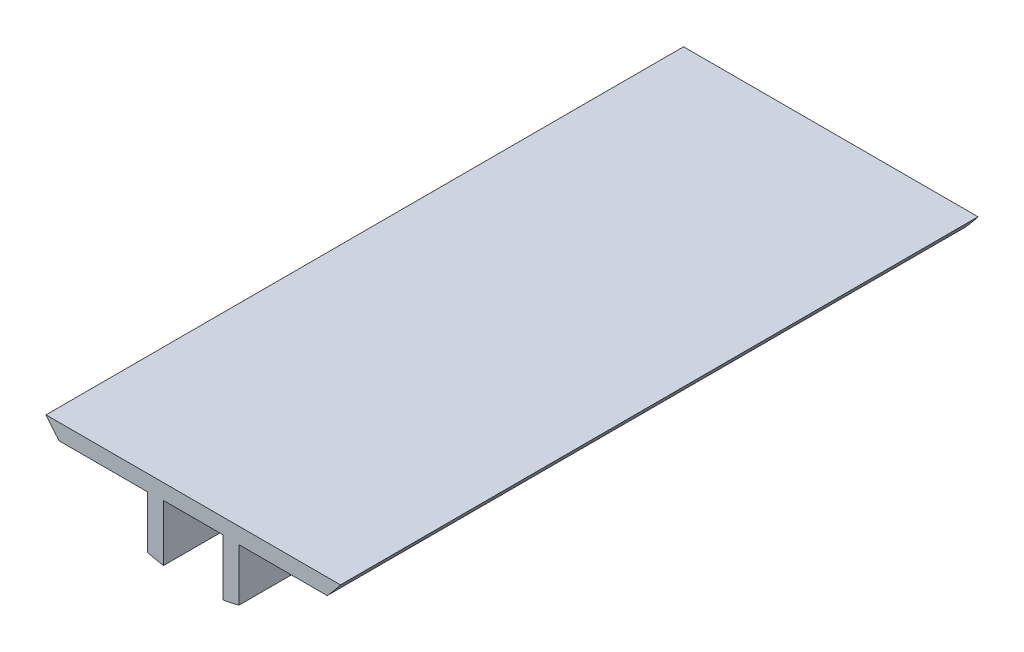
ISO-10303-21;
HEADER;
FILE_DESCRIPTION(('STEP AP214'),'2;1');
FILE_NAME('part.step','',(''),(''),'','','');
FILE_SCHEMA(('AUTOMOTIVE_DESIGN { 1 0 10303 214 1 1 1 1 }'));
ENDSEC;
DATA;
#1=APPLICATION_CONTEXT('core data for automotive mechanical design processes');
#2=APPLICATION_PROTOCOL_DEFINITION('international standard','automotive_design',2000,#1);
#3=PRODUCT_CONTEXT('',#1,'mechanical');
#4=PRODUCT('Part','Part','',(#3));
#5=PRODUCT_RELATED_PRODUCT_CATEGORY('part','',(#4));
#6=PRODUCT_DEFINITION_FORMATION('','',#4);
#7=PRODUCT_DEFINITION_CONTEXT('part definition',#1,'design');
#8=PRODUCT_DEFINITION('design','',#6,#7);
#9=PRODUCT_DEFINITION_SHAPE('','',#8);
#10=(LENGTH_UNIT() NAMED_UNIT(*) SI_UNIT(.MILLI.,.METRE.));
#11=(NAMED_UNIT(*) PLANE_ANGLE_UNIT() SI_UNIT($,.RADIAN.));
#12=(NAMED_UNIT(*) SI_UNIT($,.STERADIAN.) SOLID_ANGLE_UNIT());
#13=UNCERTAINTY_MEASURE_WITH_UNIT(LENGTH_MEASURE(1.E-05),#10,'distance_accuracy_value','');
#14=(GEOMETRIC_REPRESENTATION_CONTEXT(3) GLOBAL_UNCERTAINTY_ASSIGNED_CONTEXT((#13)) GLOBAL_UNIT_ASSIGNED_CONTEXT((#10,
#11,#12)) REPRESENTATION_CONTEXT('',''));
#15=CARTESIAN_POINT('',(0.,0.,0.));
#16=DIRECTION('',(0.,0.,1.));
#17=DIRECTION('',(1.,0.,0.));
#18=AXIS2_PLACEMENT_3D('',#15,#16,#17);
#19=CARTESIAN_POINT('',(0.,0.,-6000.));
#20=DIRECTION('',(0.,0.,1.));
#21=DIRECTION('',(1.,0.,0.));
#22=AXIS2_PLACEMENT_3D('',#19,#20,#21);
#23=CYLINDRICAL_SURFACE('',#22,1723.5);
#24=CARTESIAN_POINT('',(0.,0.,0.));
#25=DIRECTION('',(0.,0.,1.));
#26=DIRECTION('',(1.,0.,0.));
#27=AXIS2_PLACEMENT_3D('',#24,#25,#26);
#28=CIRCLE('',#27,1723.5);
#29=CARTESIAN_POINT('',(-1385.57830886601,-1025.,0.));
#30=VERTEX_POINT('',#29);
#31=CARTESIAN_POINT('',(-1260.88351960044,-1175.,0.));
#32=VERTEX_POINT('',#31);
#33=EDGE_CURVE('E166',#30,#32,#28,.T.);
#34=ORIENTED_EDGE('',*,*,#33,.F.);
#35=DIRECTION('',(0.,0.,1.));
#36=VECTOR('',#35,1.);
#37=CARTESIAN_POINT('',(-1385.57830886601,-1025.,-6000.));
#38=LINE('',#37,#36);
#39=CARTESIAN_POINT('',(-1385.57830886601,-1025.,-6000.));
#40=VERTEX_POINT('',#39);
#41=EDGE_CURVE('E11',#40,#30,#38,.T.);
#42=ORIENTED_EDGE('',*,*,#41,.F.);
#43=CARTESIAN_POINT('',(0.,0.,-6000.));
#44=DIRECTION('',(0.,0.,1.));
#45=DIRECTION('',(1.,0.,0.));
#46=AXIS2_PLACEMENT_3D('',#43,#44,#45);
#47=CIRCLE('',#46,1723.5);
#48=CARTESIAN_POINT('',(-1260.88351960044,-1175.,-6000.));
#49=VERTEX_POINT('',#48);
#50=EDGE_CURVE('E210',#40,#49,#47,.T.);
#51=ORIENTED_EDGE('',*,*,#50,.T.);
#52=DIRECTION('',(0.,0.,1.));
#53=VECTOR('',#52,1.);
#54=CARTESIAN_POINT('',(-1260.88351960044,-1175.,-6000.));
#55=LINE('',#54,#53);
#56=EDGE_CURVE('E42',#49,#32,#55,.T.);
#57=ORIENTED_EDGE('',*,*,#56,.T.);
#58=EDGE_LOOP('',(#34,#42,#51,#57));
#59=FACE_BOUND('',#58,.T.);
#60=ADVANCED_FACE('F39',(#59),#23,.T.);
#61=CARTESIAN_POINT('',(1385.57830886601,-1025.,-6000.));
#62=DIRECTION('',(0.,1.,0.));
#63=DIRECTION('',(-1.,0.,0.));
#64=AXIS2_PLACEMENT_3D('',#61,#62,#63);
#65=PLANE('',#64);
#66=DIRECTION('',(-1.,0.,0.));
#67=VECTOR('',#66,1.);
#68=CARTESIAN_POINT('',(1385.57830886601,-1025.,0.));
#69=LINE('',#68,#67);
#70=CARTESIAN_POINT('',(1385.57830886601,-1025.,0.));
#71=VERTEX_POINT('',#70);
#72=EDGE_CURVE('E207',#71,#30,#69,.T.);
#73=ORIENTED_EDGE('',*,*,#72,.F.);
#74=DIRECTION('',(0.,0.,1.));
#75=VECTOR('',#74,1.);
#76=CARTESIAN_POINT('',(1385.57830886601,-1025.,-6000.));
#77=LINE('',#76,#75);
#78=CARTESIAN_POINT('',(1385.57830886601,-1025.,-6000.));
#79=VERTEX_POINT('',#78);
#80=EDGE_CURVE('E49',#79,#71,#77,.T.);
#81=ORIENTED_EDGE('',*,*,#80,.F.);
#82=DIRECTION('',(-1.,0.,0.));
#83=VECTOR('',#82,1.);
#84=CARTESIAN_POINT('',(1385.57830886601,-1025.,-6000.));
#85=LINE('',#84,#83);
#86=EDGE_CURVE('E152',#79,#40,#85,.T.);
#87=ORIENTED_EDGE('',*,*,#86,.T.);
#88=ORIENTED_EDGE('',*,*,#41,.T.);
#89=EDGE_LOOP('',(#73,#81,#87,#88));
#90=FACE_BOUND('',#89,.T.);
#91=ADVANCED_FACE('F240',(#90),#65,.T.);
#92=CARTESIAN_POINT('',(0.,0.,-6000.));
#93=DIRECTION('',(0.,0.,1.));
#94=DIRECTION('',(1.,0.,0.));
#95=AXIS2_PLACEMENT_3D('',#92,#93,#94);
#96=CYLINDRICAL_SURFACE('',#95,1723.5);
#97=CARTESIAN_POINT('',(0.,0.,0.));
#98=DIRECTION('',(0.,0.,1.));
#99=DIRECTION('',(-1.,0.,0.));
#100=AXIS2_PLACEMENT_3D('',#97,#98,#99);
#101=CIRCLE('',#100,1723.5);
#102=CARTESIAN_POINT('',(1260.88351960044,-1175.,0.));
#103=VERTEX_POINT('',#102);
#104=EDGE_CURVE('E138',#103,#71,#101,.T.);
#105=ORIENTED_EDGE('',*,*,#104,.F.);
#106=DIRECTION('',(0.,0.,1.));
#107=VECTOR('',#106,1.);
#108=CARTESIAN_POINT('',(1260.88351960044,-1175.,-6000.));
#109=LINE('',#108,#107);
#110=CARTESIAN_POINT('',(1260.88351960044,-1175.,-6000.));
#111=VERTEX_POINT('',#110);
#112=EDGE_CURVE('E133',#111,#103,#109,.T.);
#113=ORIENTED_EDGE('',*,*,#112,.F.);
#114=CARTESIAN_POINT('',(0.,0.,-6000.));
#115=DIRECTION('',(0.,0.,1.));
#116=DIRECTION('',(-1.,0.,0.));
#117=AXIS2_PLACEMENT_3D('',#114,#115,#116);
#118=CIRCLE('',#117,1723.5);
#119=EDGE_CURVE('E136',#111,#79,#118,.T.);
#120=ORIENTED_EDGE('',*,*,#119,.T.);
#121=ORIENTED_EDGE('',*,*,#80,.T.);
#122=EDGE_LOOP('',(#105,#113,#120,#121));
#123=FACE_BOUND('',#122,.T.);
#124=ADVANCED_FACE('F135',(#123),#96,.T.);
#125=CARTESIAN_POINT('',(1260.88351960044,-1175.,-6000.));
#126=DIRECTION('',(0.,-1.,0.));
#127=DIRECTION('',(1.,0.,0.));
#128=AXIS2_PLACEMENT_3D('',#125,#126,#127);
#129=PLANE('',#128);
#130=DIRECTION('',(1.,0.,0.));
#131=VECTOR('',#130,1.);
#132=CARTESIAN_POINT('',(1260.88351960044,-1175.,0.));
#133=LINE('',#132,#131);
#134=CARTESIAN_POINT('',(429.805300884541,-1175.,0.));
#135=VERTEX_POINT('',#134);
#136=EDGE_CURVE('E202',#135,#103,#133,.T.);
#137=ORIENTED_EDGE('',*,*,#136,.F.);
#138=DIRECTION('',(0.,0.,1.));
#139=VECTOR('',#138,1.);
#140=CARTESIAN_POINT('',(429.805300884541,-1175.,-6000.));
#141=LINE('',#140,#139);
#142=CARTESIAN_POINT('',(429.805300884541,-1175.,-6000.));
#143=VERTEX_POINT('',#142);
#144=EDGE_CURVE('E144',#143,#135,#141,.T.);
#145=ORIENTED_EDGE('',*,*,#144,.F.);
#146=DIRECTION('',(1.,0.,0.));
#147=VECTOR('',#146,1.);
#148=CARTESIAN_POINT('',(1260.88351960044,-1175.,-6000.));
#149=LINE('',#148,#147);
#150=EDGE_CURVE('E150',#143,#111,#149,.T.);
#151=ORIENTED_EDGE('',*,*,#150,.T.);
#152=ORIENTED_EDGE('',*,*,#112,.T.);
#153=EDGE_LOOP('',(#137,#145,#151,#152));
#154=FACE_BOUND('',#153,.T.);
#155=ADVANCED_FACE('F155',(#154),#129,.T.);
#156=CARTESIAN_POINT('',(429.805300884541,-1175.,-6000.));
#157=DIRECTION('',(1.,0.,0.));
#158=DIRECTION('',(0.,1.,0.));
#159=AXIS2_PLACEMENT_3D('',#156,#157,#158);
#160=PLANE('',#159);
#161=DIRECTION('',(0.,1.,0.));
#162=VECTOR('',#161,1.);
#163=CARTESIAN_POINT('',(429.805300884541,-1175.,0.));
#164=LINE('',#163,#162);
#165=CARTESIAN_POINT('',(429.805300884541,-1669.04752878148,0.));
#166=VERTEX_POINT('',#165);
#167=EDGE_CURVE('E198',#166,#135,#164,.T.);
#168=ORIENTED_EDGE('',*,*,#167,.F.);
#169=DIRECTION('',(0.,0.,1.));
#170=VECTOR('',#169,1.);
#171=CARTESIAN_POINT('',(429.805300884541,-1669.04752878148,-6000.));
#172=LINE('',#171,#170);
#173=CARTESIAN_POINT('',(429.805300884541,-1669.04752878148,-6000.));
#174=VERTEX_POINT('',#173);
#175=EDGE_CURVE('E216',#174,#166,#172,.T.);
#176=ORIENTED_EDGE('',*,*,#175,.F.);
#177=DIRECTION('',(0.,1.,0.));
#178=VECTOR('',#177,1.);
#179=CARTESIAN_POINT('',(429.805300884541,-1175.,-6000.));
#180=LINE('',#179,#178);
#181=EDGE_CURVE('E157',#174,#143,#180,.T.);
#182=ORIENTED_EDGE('',*,*,#181,.T.);
#183=ORIENTED_EDGE('',*,*,#144,.T.);
#184=EDGE_LOOP('',(#168,#176,#182,#183));
#185=FACE_BOUND('',#184,.T.);
#186=ADVANCED_FACE('F253',(#185),#160,.T.);
#187=CARTESIAN_POINT('',(0.,0.,-6000.));
#188=DIRECTION('',(0.,0.,1.));
#189=DIRECTION('',(1.,0.,0.));
#190=AXIS2_PLACEMENT_3D('',#187,#188,#189);
#191=CYLINDRICAL_SURFACE('',#190,1723.5);
#192=CARTESIAN_POINT('',(0.,0.,0.));
#193=DIRECTION('',(0.,0.,1.));
#194=DIRECTION('',(-1.,0.,0.));
#195=AXIS2_PLACEMENT_3D('',#192,#193,#194);
#196=CIRCLE('',#195,1723.5);
#197=CARTESIAN_POINT('',(279.805300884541,-1700.63554108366,0.));
#198=VERTEX_POINT('',#197);
#199=EDGE_CURVE('E194',#198,#166,#196,.T.);
#200=ORIENTED_EDGE('',*,*,#199,.F.);
#201=DIRECTION('',(0.,0.,1.));
#202=VECTOR('',#201,1.);
#203=CARTESIAN_POINT('',(279.805300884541,-1700.63554108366,-6000.));
#204=LINE('',#203,#202);
#205=CARTESIAN_POINT('',(279.805300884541,-1700.63554108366,-6000.));
#206=VERTEX_POINT('',#205);
#207=EDGE_CURVE('E219',#206,#198,#204,.T.);
#208=ORIENTED_EDGE('',*,*,#207,.F.);
#209=CARTESIAN_POINT('',(0.,0.,-6000.));
#210=DIRECTION('',(0.,0.,1.));
#211=DIRECTION('',(-1.,0.,0.));
#212=AXIS2_PLACEMENT_3D('',#209,#210,#211);
#213=CIRCLE('',#212,1723.5);
#214=EDGE_CURVE('E160',#206,#174,#213,.T.);
#215=ORIENTED_EDGE('',*,*,#214,.T.);
#216=ORIENTED_EDGE('',*,*,#175,.T.);
#217=EDGE_LOOP('',(#200,#208,#215,#216));
#218=FACE_BOUND('',#217,.T.);
#219=ADVANCED_FACE('F256',(#218),#191,.T.);
#220=CARTESIAN_POINT('',(279.805300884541,-1700.63554108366,-6000.));
#221=DIRECTION('',(-1.,0.,0.));
#222=DIRECTION('',(0.,-1.,0.));
#223=AXIS2_PLACEMENT_3D('',#220,#221,#222);
#224=PLANE('',#223);
#225=DIRECTION('',(0.,-1.,0.));
#226=VECTOR('',#225,1.);
#227=CARTESIAN_POINT('',(279.805300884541,-1700.63554108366,0.));
#228=LINE('',#227,#226);
#229=CARTESIAN_POINT('',(279.805300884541,-1169.79138438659,0.));
#230=VERTEX_POINT('',#229);
#231=EDGE_CURVE('E190',#230,#198,#228,.T.);
#232=ORIENTED_EDGE('',*,*,#231,.F.);
#233=DIRECTION('',(0.,0.,1.));
#234=VECTOR('',#233,1.);
#235=CARTESIAN_POINT('',(279.805300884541,-1169.79138438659,-6000.));
#236=LINE('',#235,#234);
#237=CARTESIAN_POINT('',(279.805300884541,-1169.79138438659,-6000.));
#238=VERTEX_POINT('',#237);
#239=EDGE_CURVE('E222',#238,#230,#236,.T.);
#240=ORIENTED_EDGE('',*,*,#239,.F.);
#241=DIRECTION('',(0.,-1.,0.));
#242=VECTOR('',#241,1.);
#243=CARTESIAN_POINT('',(279.805300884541,-1700.63554108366,-6000.));
#244=LINE('',#243,#242);
#245=EDGE_CURVE('E382',#238,#206,#244,.T.);
#246=ORIENTED_EDGE('',*,*,#245,.T.);
#247=ORIENTED_EDGE('',*,*,#207,.T.);
#248=EDGE_LOOP('',(#232,#240,#246,#247));
#249=FACE_BOUND('',#248,.T.);
#250=ADVANCED_FACE('F260',(#249),#224,.T.);
#251=CARTESIAN_POINT('',(-279.805300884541,-1169.79138438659,-6000.));
#252=DIRECTION('',(0.,-1.,0.));
#253=DIRECTION('',(1.,0.,0.));
#254=AXIS2_PLACEMENT_3D('',#251,#252,#253);
#255=PLANE('',#254);
#256=DIRECTION('',(1.,0.,0.));
#257=VECTOR('',#256,1.);
#258=CARTESIAN_POINT('',(-279.805300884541,-1169.79138438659,0.));
#259=LINE('',#258,#257);
#260=CARTESIAN_POINT('',(-279.805300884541,-1169.79138438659,0.));
#261=VERTEX_POINT('',#260);
#262=EDGE_CURVE('E186',#261,#230,#259,.T.);
#263=ORIENTED_EDGE('',*,*,#262,.F.);
#264=DIRECTION('',(0.,0.,1.));
#265=VECTOR('',#264,1.);
#266=CARTESIAN_POINT('',(-279.805300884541,-1169.79138438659,-6000.));
#267=LINE('',#266,#265);
#268=CARTESIAN_POINT('',(-279.805300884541,-1169.79138438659,-6000.));
#269=VERTEX_POINT('',#268);
#270=EDGE_CURVE('E225',#269,#261,#267,.T.);
#271=ORIENTED_EDGE('',*,*,#270,.F.);
#272=DIRECTION('',(1.,0.,0.));
#273=VECTOR('',#272,1.);
#274=CARTESIAN_POINT('',(-279.805300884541,-1169.79138438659,-6000.));
#275=LINE('',#274,#273);
#276=EDGE_CURVE('E388',#269,#238,#275,.T.);
#277=ORIENTED_EDGE('',*,*,#276,.T.);
#278=ORIENTED_EDGE('',*,*,#239,.T.);
#279=EDGE_LOOP('',(#263,#271,#277,#278));
#280=FACE_BOUND('',#279,.T.);
#281=ADVANCED_FACE('F264',(#280),#255,.T.);
#282=CARTESIAN_POINT('',(-279.805300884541,-1700.63554108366,-6000.));
#283=DIRECTION('',(1.,0.,0.));
#284=DIRECTION('',(0.,0.,-1.));
#285=AXIS2_PLACEMENT_3D('',#282,#283,#284);
#286=PLANE('',#285);
#287=DIRECTION('',(0.,1.,0.));
#288=VECTOR('',#287,1.);
#289=CARTESIAN_POINT('',(-279.805300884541,-1700.63554108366,0.));
#290=LINE('',#289,#288);
#291=CARTESIAN_POINT('',(-279.805300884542,-1700.63554108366,0.));
#292=VERTEX_POINT('',#291);
#293=EDGE_CURVE('E182',#292,#261,#290,.T.);
#294=ORIENTED_EDGE('',*,*,#293,.F.);
#295=DIRECTION('',(0.,0.,1.));
#296=VECTOR('',#295,1.);
#297=CARTESIAN_POINT('',(-279.805300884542,-1700.63554108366,-6000.));
#298=LINE('',#297,#296);
#299=CARTESIAN_POINT('',(-279.805300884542,-1700.63554108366,-6000.));
#300=VERTEX_POINT('',#299);
#301=EDGE_CURVE('E228',#300,#292,#298,.T.);
#302=ORIENTED_EDGE('',*,*,#301,.F.);
#303=DIRECTION('',(0.,1.,0.));
#304=VECTOR('',#303,1.);
#305=CARTESIAN_POINT('',(-279.805300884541,-1700.63554108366,-6000.));
#306=LINE('',#305,#304);
#307=EDGE_CURVE('E375',#300,#269,#306,.T.);
#308=ORIENTED_EDGE('',*,*,#307,.T.);
#309=ORIENTED_EDGE('',*,*,#270,.T.);
#310=EDGE_LOOP('',(#294,#302,#308,#309));
#311=FACE_BOUND('',#310,.T.);
#312=ADVANCED_FACE('F268',(#311),#286,.T.);
#313=CARTESIAN_POINT('',(0.,0.,-6000.));
#314=DIRECTION('',(0.,0.,1.));
#315=DIRECTION('',(1.,0.,0.));
#316=AXIS2_PLACEMENT_3D('',#313,#314,#315);
#317=CYLINDRICAL_SURFACE('',#316,1723.5);
#318=CARTESIAN_POINT('',(0.,0.,0.));
#319=DIRECTION('',(0.,0.,1.));
#320=DIRECTION('',(1.,0.,0.));
#321=AXIS2_PLACEMENT_3D('',#318,#319,#320);
#322=CIRCLE('',#321,1723.5);
#323=CARTESIAN_POINT('',(-429.805300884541,-1669.04752878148,0.));
#324=VERTEX_POINT('',#323);
#325=EDGE_CURVE('E178',#324,#292,#322,.T.);
#326=ORIENTED_EDGE('',*,*,#325,.F.);
#327=DIRECTION('',(0.,0.,1.));
#328=VECTOR('',#327,1.);
#329=CARTESIAN_POINT('',(-429.805300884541,-1669.04752878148,-6000.));
#330=LINE('',#329,#328);
#331=CARTESIAN_POINT('',(-429.805300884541,-1669.04752878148,-6000.));
#332=VERTEX_POINT('',#331);
#333=EDGE_CURVE('E231',#332,#324,#330,.T.);
#334=ORIENTED_EDGE('',*,*,#333,.F.);
#335=CARTESIAN_POINT('',(0.,0.,-6000.));
#336=DIRECTION('',(0.,0.,1.));
#337=DIRECTION('',(1.,0.,0.));
#338=AXIS2_PLACEMENT_3D('',#335,#336,#337);
#339=CIRCLE('',#338,1723.5);
#340=EDGE_CURVE('E371',#332,#300,#339,.T.);
#341=ORIENTED_EDGE('',*,*,#340,.T.);
#342=ORIENTED_EDGE('',*,*,#301,.T.);
#343=EDGE_LOOP('',(#326,#334,#341,#342));
#344=FACE_BOUND('',#343,.T.);
#345=ADVANCED_FACE('F272',(#344),#317,.T.);
#346=CARTESIAN_POINT('',(-429.805300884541,-1175.,-6000.));
#347=DIRECTION('',(-1.,0.,0.));
#348=DIRECTION('',(0.,-1.,0.));
#349=AXIS2_PLACEMENT_3D('',#346,#347,#348);
#350=PLANE('',#349);
#351=DIRECTION('',(0.,-1.,0.));
#352=VECTOR('',#351,1.);
#353=CARTESIAN_POINT('',(-429.805300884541,-1175.,0.));
#354=LINE('',#353,#352);
#355=CARTESIAN_POINT('',(-429.805300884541,-1175.,0.));
#356=VERTEX_POINT('',#355);
#357=EDGE_CURVE('E174',#356,#324,#354,.T.);
#358=ORIENTED_EDGE('',*,*,#357,.F.);
#359=DIRECTION('',(0.,0.,1.));
#360=VECTOR('',#359,1.);
#361=CARTESIAN_POINT('',(-429.805300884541,-1175.,-6000.));
#362=LINE('',#361,#360);
#363=CARTESIAN_POINT('',(-429.805300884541,-1175.,-6000.));
#364=VERTEX_POINT('',#363);
#365=EDGE_CURVE('E233',#364,#356,#362,.T.);
#366=ORIENTED_EDGE('',*,*,#365,.F.);
#367=DIRECTION('',(0.,-1.,0.));
#368=VECTOR('',#367,1.);
#369=CARTESIAN_POINT('',(-429.805300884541,-1175.,-6000.));
#370=LINE('',#369,#368);
#371=EDGE_CURVE('E397',#364,#332,#370,.T.);
#372=ORIENTED_EDGE('',*,*,#371,.T.);
#373=ORIENTED_EDGE('',*,*,#333,.T.);
#374=EDGE_LOOP('',(#358,#366,#372,#373));
#375=FACE_BOUND('',#374,.T.);
#376=ADVANCED_FACE('F276',(#375),#350,.T.);
#377=CARTESIAN_POINT('',(-1260.88351960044,-1175.,-6000.));
#378=DIRECTION('',(0.,-1.,0.));
#379=DIRECTION('',(0.,0.,-1.));
#380=AXIS2_PLACEMENT_3D('',#377,#378,#379);
#381=PLANE('',#380);
#382=DIRECTION('',(1.,0.,0.));
#383=VECTOR('',#382,1.);
#384=CARTESIAN_POINT('',(-1260.88351960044,-1175.,0.));
#385=LINE('',#384,#383);
#386=EDGE_CURVE('E170',#32,#356,#385,.T.);
#387=ORIENTED_EDGE('',*,*,#386,.F.);
#388=ORIENTED_EDGE('',*,*,#56,.F.);
#389=DIRECTION('',(1.,0.,0.));
#390=VECTOR('',#389,1.);
#391=CARTESIAN_POINT('',(-1260.88351960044,-1175.,-6000.));
#392=LINE('',#391,#390);
#393=EDGE_CURVE('E400',#49,#364,#392,.T.);
#394=ORIENTED_EDGE('',*,*,#393,.T.);
#395=ORIENTED_EDGE('',*,*,#365,.T.);
#396=EDGE_LOOP('',(#387,#388,#394,#395));
#397=FACE_BOUND('',#396,.T.);
#398=ADVANCED_FACE('F237',(#397),#381,.T.);
#399=CARTESIAN_POINT('',(0.,0.,-6000.));
#400=DIRECTION('',(0.,0.,1.));
#401=DIRECTION('',(1.,0.,0.));
#402=AXIS2_PLACEMENT_3D('',#399,#400,#401);
#403=PLANE('',#402);
#404=ORIENTED_EDGE('',*,*,#50,.F.);
#405=ORIENTED_EDGE('',*,*,#86,.F.);
#406=ORIENTED_EDGE('',*,*,#119,.F.);
#407=ORIENTED_EDGE('',*,*,#150,.F.);
#408=ORIENTED_EDGE('',*,*,#181,.F.);
#409=ORIENTED_EDGE('',*,*,#214,.F.);
#410=ORIENTED_EDGE('',*,*,#245,.F.);
#411=ORIENTED_EDGE('',*,*,#276,.F.);
#412=ORIENTED_EDGE('',*,*,#307,.F.);
#413=ORIENTED_EDGE('',*,*,#340,.F.);
#414=ORIENTED_EDGE('',*,*,#371,.F.);
#415=ORIENTED_EDGE('',*,*,#393,.F.);
#416=EDGE_LOOP('',(#404,#405,#406,#407,#408,#409,#410,#411,#412,#413,#414,#415));
#417=FACE_BOUND('',#416,.T.);
#418=ADVANCED_FACE('F148',(#417),#403,.F.);
#419=CARTESIAN_POINT('',(0.,0.,0.));
#420=DIRECTION('',(0.,0.,1.));
#421=DIRECTION('',(1.,0.,0.));
#422=AXIS2_PLACEMENT_3D('',#419,#420,#421);
#423=PLANE('',#422);
#424=ORIENTED_EDGE('',*,*,#33,.T.);
#425=ORIENTED_EDGE('',*,*,#386,.T.);
#426=ORIENTED_EDGE('',*,*,#357,.T.);
#427=ORIENTED_EDGE('',*,*,#325,.T.);
#428=ORIENTED_EDGE('',*,*,#293,.T.);
#429=ORIENTED_EDGE('',*,*,#262,.T.);
#430=ORIENTED_EDGE('',*,*,#231,.T.);
#431=ORIENTED_EDGE('',*,*,#199,.T.);
#432=ORIENTED_EDGE('',*,*,#167,.T.);
#433=ORIENTED_EDGE('',*,*,#136,.T.);
#434=ORIENTED_EDGE('',*,*,#104,.T.);
#435=ORIENTED_EDGE('',*,*,#72,.T.);
#436=EDGE_LOOP('',(#424,#425,#426,#427,#428,#429,#430,#431,#432,#433,#434,#435));
#437=FACE_BOUND('',#436,.T.);
#438=ADVANCED_FACE('F239',(#437),#423,.T.);
#439=CLOSED_SHELL('',(#60,#91,#124,#155,#186,#219,#250,#281,#312,#345,#376,#398,#418,#438));
#440=MANIFOLD_SOLID_BREP('B2',#439);
#441=ADVANCED_BREP_SHAPE_REPRESENTATION('',(#18,#440),#14);
#442=SHAPE_DEFINITION_REPRESENTATION(#9,#441);
ENDSEC;
END-ISO-10303-21;
